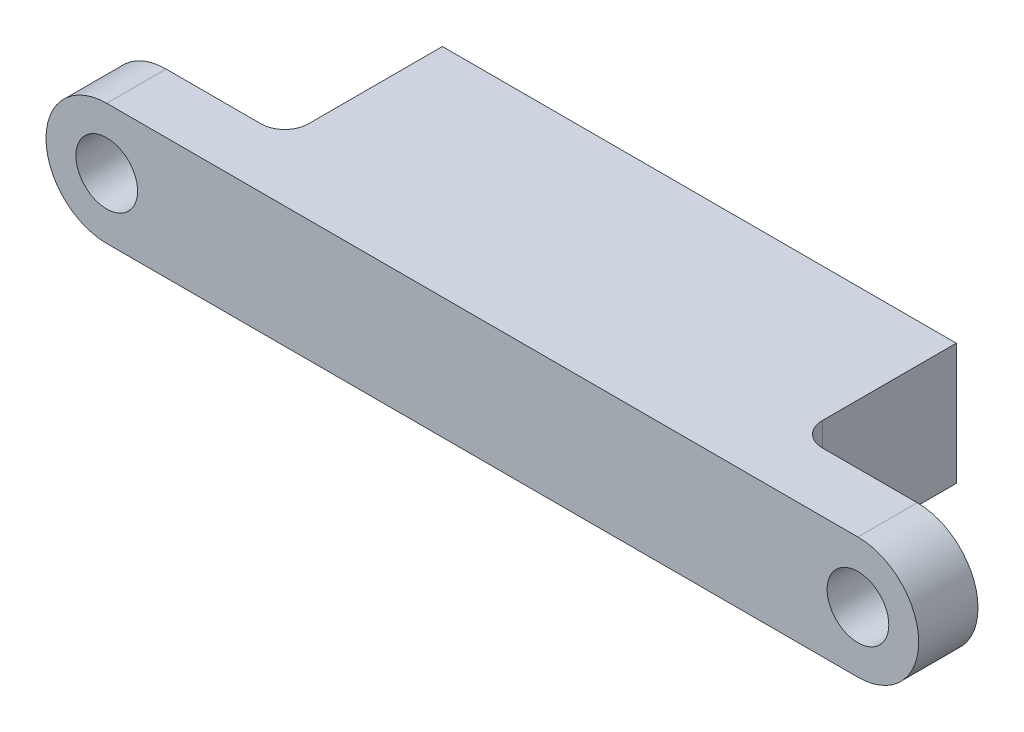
from build123d import *

# Parameters (mm, degrees)
SKETCH1_W           = 55
SKETCH1_H           = 13
SKETCH1_R           = 2.25
BOSS_EXTRUDE1_DEPTH = 23.224999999
SKETCH2_R           = 3.302
BOSS_EXTRUDE2_DEPTH = 6.35
FILLET1_R           = 2.54
SKETCH4_R           = 2.25
BOSS_EXTRUDE4_DEPTH = 23.114


with BuildPart() as part:
    # Sketch1 → Boss-Extrude1 (new body)
    with BuildSketch(Plane(origin=(0, 0, 1271.988034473), x_dir=(-1, 0, 0), z_dir=(0, 0, -1))):
        with Locations((-462.575693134, 1224.120161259)):
            Rectangle(SKETCH1_W, SKETCH1_H)
        with Locations(Location((-483.575693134, 1224.120161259, 0), (0, 0, 90))):
            Circle(SKETCH1_R, mode=Mode.SUBTRACT)
        with Locations(Location((-441.575693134, 1224.120161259, 0), (0, 0, 90))):
            Circle(SKETCH1_R, mode=Mode.SUBTRACT)
    extrude(amount=BOSS_EXTRUDE1_DEPTH)

    # Sketch2 → Boss-Extrude2 (add)
    # profile 1 of 2: a face of its own
    with BuildSketch(Plane.XY.offset(1271.988034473)):
        with BuildLine():
            Line((435.075693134, 1230.620161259), (435.075693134, 1217.620161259))
            Line((435.075693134, 1217.620161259), (422.375693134, 1217.620161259))
            ThreePointArc((422.375693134, 1217.620161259), (415.875693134, 1224.120161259), (422.375693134, 1230.620161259))
            Line((422.375693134, 1230.620161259), (435.075693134, 1230.620161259))
        make_face()
        with Locations((422.375693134, 1224.120161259)):
            Circle(SKETCH2_R, mode=Mode.SUBTRACT)
    # profile 2 of 2: a face of its own
    with BuildSketch(Plane.XY.offset(1271.988034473)):
        with BuildLine():
            Line((502.775693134, 1230.620161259), (490.075693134, 1230.620161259))
            Line((490.075693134, 1230.620161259), (490.075693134, 1217.620161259))
            Line((490.075693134, 1217.620161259), (502.775693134, 1217.620161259))
            ThreePointArc((502.775693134, 1217.620161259), (509.275693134, 1224.120161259), (502.775693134, 1230.620161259))
        make_face()
        with Locations((502.775693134, 1224.120161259)):
            Circle(SKETCH2_R, mode=Mode.SUBTRACT)
    extrude(amount=-BOSS_EXTRUDE2_DEPTH)

    # Fillet1
    fillet1_edges = [part.edges().sort_by_distance(p)[0] for p in [
        (435.075693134, 1224.120161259, 1265.638034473),
        (490.075693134, 1224.120161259, 1265.638034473),
    ]]
    fillet(fillet1_edges, radius=FILLET1_R)

    # Sketch4 → Boss-Extrude4 (add)
    with BuildSketch(Plane.XY.offset(1271.988034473)):
        with Locations((441.575693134, 1224.120161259)):
            Circle(SKETCH4_R)
        with Locations((483.575693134, 1224.120161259)):
            Circle(SKETCH4_R)
    extrude(amount=-BOSS_EXTRUDE4_DEPTH)

    # Sketch5 → Cut-Revolve1 (revolve, cut)
    with BuildSketch(Plane(origin=(0, 1224.120161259, 0), x_dir=(1, 0, 0), z_dir=(0, 1, 0))):
        Polygon((483.575693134, -1248.874034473), (485.825693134, -1248.874034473), (483.575693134, -1250.461534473), align=None)
    revolve(axis=Axis((483.575693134, 1224.120161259, 1250.461534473), (0, 0, -1)), mode=Mode.SUBTRACT)

    # Sketch7 → Cut-Revolve2 (revolve, cut)
    with BuildSketch(Plane(origin=(0, 1224.120161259, 0), x_dir=(1, 0, 0), z_dir=(0, 1, 0))):
        Polygon((441.575693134, -1248.763034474), (443.825693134, -1248.763034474), (441.575693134, -1250.350534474), align=None)
    revolve(axis=Axis((441.575693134, 1224.120161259, 1248.763034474), (0, 0, -1)), mode=Mode.SUBTRACT)


solid = part.part
